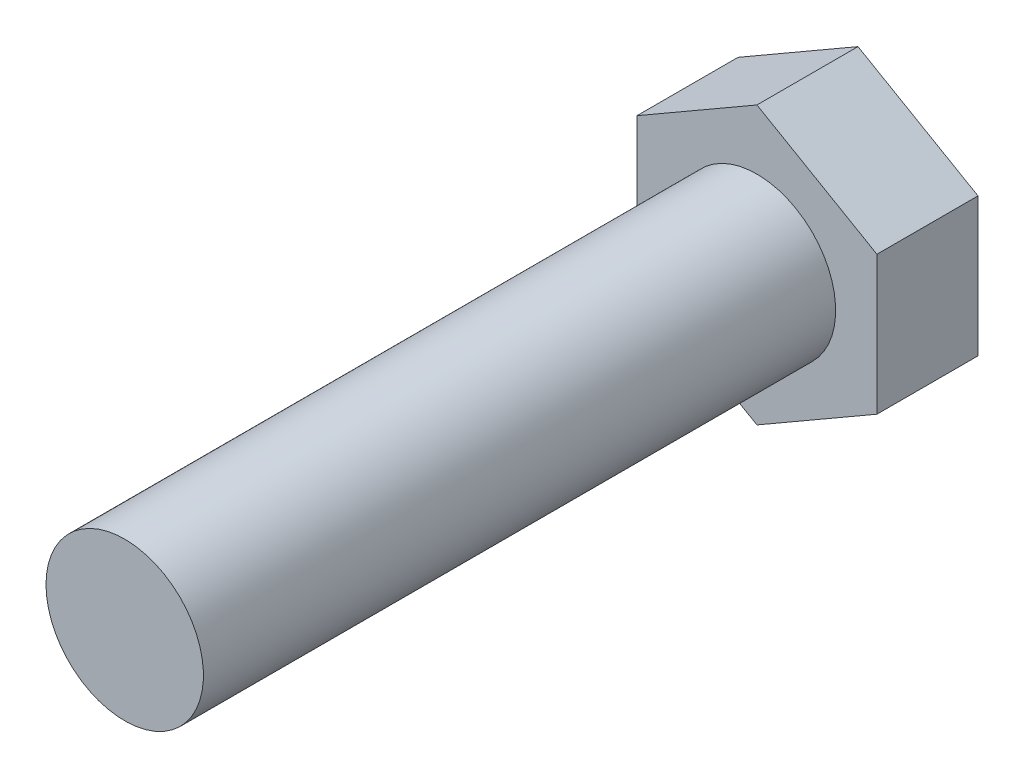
from build123d import *

# Parameters (mm, degrees)
BASE_EXTRUDE_DEPTH  = 5.969
SKETCH2_R           = 4.6482
BOSS_EXTRUDE1_DEPTH = 37.338


with BuildPart() as part:
    # Sketch1 → Base-Extrude (new body)
    with BuildSketch(Plane.XY):
        Polygon((0, 8.182900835), (-7.0866, 4.091450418), (-7.0866, -4.091450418), (0, -8.182900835), (7.0866, -4.091450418), (7.0866, 4.091450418), align=None)
    extrude(amount=BASE_EXTRUDE_DEPTH)

    # Sketch2 → Boss-Extrude1 (add)
    with BuildSketch(Plane.XY.offset(5.969)):
        with Locations(Location((0, 0, 0), (0, 0, 180))):
            Circle(SKETCH2_R)
    extrude(amount=BOSS_EXTRUDE1_DEPTH)


solid = part.part
